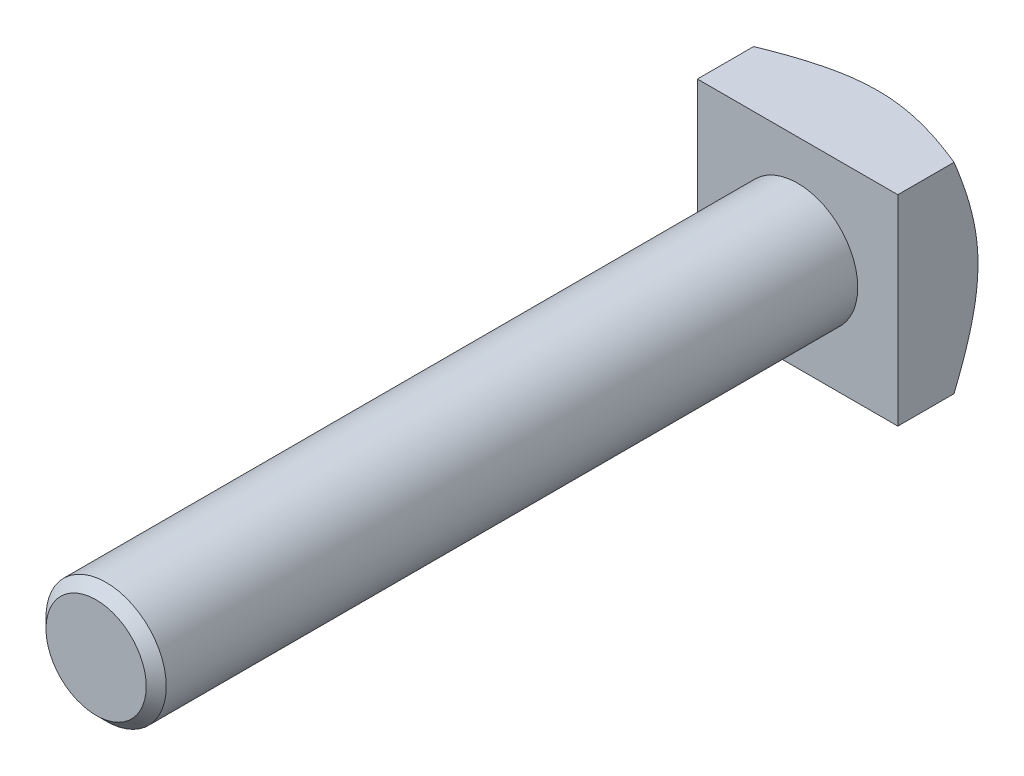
ISO-10303-21;
HEADER;
FILE_DESCRIPTION(('STEP AP214'),'2;1');
FILE_NAME('part.step','',(''),(''),'','','');
FILE_SCHEMA(('AUTOMOTIVE_DESIGN { 1 0 10303 214 1 1 1 1 }'));
ENDSEC;
DATA;
#1=APPLICATION_CONTEXT('core data for automotive mechanical design processes');
#2=APPLICATION_PROTOCOL_DEFINITION('international standard','automotive_design',2000,#1);
#3=PRODUCT_CONTEXT('',#1,'mechanical');
#4=PRODUCT('Part','Part','',(#3));
#5=PRODUCT_RELATED_PRODUCT_CATEGORY('part','',(#4));
#6=PRODUCT_DEFINITION_FORMATION('','',#4);
#7=PRODUCT_DEFINITION_CONTEXT('part definition',#1,'design');
#8=PRODUCT_DEFINITION('design','',#6,#7);
#9=PRODUCT_DEFINITION_SHAPE('','',#8);
#10=(LENGTH_UNIT() NAMED_UNIT(*) SI_UNIT(.MILLI.,.METRE.));
#11=(NAMED_UNIT(*) PLANE_ANGLE_UNIT() SI_UNIT($,.RADIAN.));
#12=(NAMED_UNIT(*) SI_UNIT($,.STERADIAN.) SOLID_ANGLE_UNIT());
#13=UNCERTAINTY_MEASURE_WITH_UNIT(LENGTH_MEASURE(1.E-05),#10,'distance_accuracy_value','');
#14=(GEOMETRIC_REPRESENTATION_CONTEXT(3) GLOBAL_UNCERTAINTY_ASSIGNED_CONTEXT((#13)) GLOBAL_UNIT_ASSIGNED_CONTEXT((#10,
#11,#12)) REPRESENTATION_CONTEXT('',''));
#15=CARTESIAN_POINT('',(0.,0.,0.));
#16=DIRECTION('',(0.,0.,1.));
#17=DIRECTION('',(1.,0.,0.));
#18=AXIS2_PLACEMENT_3D('',#15,#16,#17);
#19=CARTESIAN_POINT('',(-5.,5.,0.));
#20=DIRECTION('',(0.,0.,1.));
#21=DIRECTION('',(1.,0.,0.));
#22=AXIS2_PLACEMENT_3D('',#19,#20,#21);
#23=PLANE('',#22);
#24=DIRECTION('',(0.,-1.,0.));
#25=VECTOR('',#24,1.);
#26=CARTESIAN_POINT('',(-5.,5.,0.));
#27=LINE('',#26,#25);
#28=CARTESIAN_POINT('',(-5.,5.,0.));
#29=VERTEX_POINT('',#28);
#30=CARTESIAN_POINT('',(-5.,-5.,0.));
#31=VERTEX_POINT('',#30);
#32=EDGE_CURVE('E105',#29,#31,#27,.T.);
#33=ORIENTED_EDGE('',*,*,#32,.T.);
#34=DIRECTION('',(1.,0.,0.));
#35=VECTOR('',#34,1.);
#36=CARTESIAN_POINT('',(-5.,-5.,0.));
#37=LINE('',#36,#35);
#38=CARTESIAN_POINT('',(5.,-5.,0.));
#39=VERTEX_POINT('',#38);
#40=EDGE_CURVE('E291',#31,#39,#37,.T.);
#41=ORIENTED_EDGE('',*,*,#40,.T.);
#42=DIRECTION('',(0.,1.,0.));
#43=VECTOR('',#42,1.);
#44=CARTESIAN_POINT('',(5.,5.,0.));
#45=LINE('',#44,#43);
#46=CARTESIAN_POINT('',(5.,5.,0.));
#47=VERTEX_POINT('',#46);
#48=EDGE_CURVE('E290',#39,#47,#45,.T.);
#49=ORIENTED_EDGE('',*,*,#48,.T.);
#50=DIRECTION('',(-1.,0.,0.));
#51=VECTOR('',#50,1.);
#52=CARTESIAN_POINT('',(-5.,5.,0.));
#53=LINE('',#52,#51);
#54=EDGE_CURVE('E117',#47,#29,#53,.T.);
#55=ORIENTED_EDGE('',*,*,#54,.T.);
#56=EDGE_LOOP('',(#33,#41,#49,#55));
#57=FACE_BOUND('',#56,.T.);
#58=CARTESIAN_POINT('',(0.,0.,0.));
#59=DIRECTION('',(0.,0.,1.));
#60=DIRECTION('',(1.,0.,0.));
#61=AXIS2_PLACEMENT_3D('',#58,#59,#60);
#62=CIRCLE('',#61,3.);
#63=CARTESIAN_POINT('',(3.,0.,0.));
#64=VERTEX_POINT('',#63);
#65=EDGE_CURVE('E196',#64,#64,#62,.T.);
#66=ORIENTED_EDGE('',*,*,#65,.F.);
#67=EDGE_LOOP('',(#66));
#68=FACE_BOUND('',#67,.T.);
#69=ADVANCED_FACE('F34',(#57,#68),#23,.T.);
#70=CARTESIAN_POINT('',(-5.,5.,-4.));
#71=DIRECTION('',(-1.,0.,0.));
#72=DIRECTION('',(0.,-1.,0.));
#73=AXIS2_PLACEMENT_3D('',#70,#71,#72);
#74=PLANE('',#73);
#75=DIRECTION('',(0.,0.,1.));
#76=VECTOR('',#75,1.);
#77=CARTESIAN_POINT('',(-5.,5.,-4.));
#78=LINE('',#77,#76);
#79=CARTESIAN_POINT('',(-5.,5.,-2.80426844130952));
#80=VERTEX_POINT('',#79);
#81=EDGE_CURVE('E100',#80,#29,#78,.T.);
#82=ORIENTED_EDGE('',*,*,#81,.F.);
#83=CARTESIAN_POINT('',(-5.,-9.8181322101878,-0.525521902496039));
#84=CARTESIAN_POINT('',(-5.,-9.57661979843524,-0.649754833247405));
#85=CARTESIAN_POINT('',(-5.,-9.33473590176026,-0.773272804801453));
#86=CARTESIAN_POINT('',(-5.,-8.85003214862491,-1.01849672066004));
#87=CARTESIAN_POINT('',(-5.,-8.60721223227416,-1.14020254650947));
#88=CARTESIAN_POINT('',(-5.,-8.11989074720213,-1.38169323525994));
#89=CARTESIAN_POINT('',(-5.,-7.87538654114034,-1.50147278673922));
#90=CARTESIAN_POINT('',(-5.,-7.38504530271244,-1.73826229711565));
#91=CARTESIAN_POINT('',(-5.,-7.13920830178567,-1.85527232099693));
#92=CARTESIAN_POINT('',(-5.,-6.63230240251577,-2.09216909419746));
#93=CARTESIAN_POINT('',(-5.,-6.37114106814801,-2.21185870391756));
#94=CARTESIAN_POINT('',(-5.,-5.84655275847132,-2.4462350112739));
#95=CARTESIAN_POINT('',(-5.,-5.58312563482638,-2.56092137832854));
#96=CARTESIAN_POINT('',(-5.,-5.05372038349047,-2.78361353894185));
#97=CARTESIAN_POINT('',(-5.,-4.78774472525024,-2.8916251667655));
#98=CARTESIAN_POINT('',(-5.,-4.25242340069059,-3.09889095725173));
#99=CARTESIAN_POINT('',(-5.,-3.98307829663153,-3.19814655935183));
#100=CARTESIAN_POINT('',(-5.,-3.44329486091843,-3.38390258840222));
#101=CARTESIAN_POINT('',(-5.,-3.17290140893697,-3.47053170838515));
#102=CARTESIAN_POINT('',(-5.,-2.62760842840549,-3.62849436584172));
#103=CARTESIAN_POINT('',(-5.,-2.35270885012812,-3.6998277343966));
#104=CARTESIAN_POINT('',(-5.,-1.80366332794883,-3.82133150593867));
#105=CARTESIAN_POINT('',(-5.,-1.52960459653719,-3.87188258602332));
#106=CARTESIAN_POINT('',(-5.,-1.11606109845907,-3.92997071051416));
#107=CARTESIAN_POINT('',(-5.,-0.977799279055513,-3.9463772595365));
#108=CARTESIAN_POINT('',(-5.,-0.700676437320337,-3.97285973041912));
#109=CARTESIAN_POINT('',(-5.,-0.561815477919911,-3.98293630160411));
#110=CARTESIAN_POINT('',(-5.,-0.25566039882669,-3.99782694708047));
#111=CARTESIAN_POINT('',(-5.,-0.088292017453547,-4.00116576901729));
#112=CARTESIAN_POINT('',(-5.,0.24635848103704,-3.99811302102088));
#113=CARTESIAN_POINT('',(-5.,0.413640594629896,-3.99172108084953));
#114=CARTESIAN_POINT('',(-5.,0.747605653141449,-3.96948164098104));
#115=CARTESIAN_POINT('',(-5.,0.914288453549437,-3.95363199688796));
#116=CARTESIAN_POINT('',(-5.,1.24656987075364,-3.91311443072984));
#117=CARTESIAN_POINT('',(-5.,1.41216845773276,-3.88844626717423));
#118=CARTESIAN_POINT('',(-5.,1.7464533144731,-3.83039231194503));
#119=CARTESIAN_POINT('',(-5.,1.91510124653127,-3.79678789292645));
#120=CARTESIAN_POINT('',(-5.,2.25076132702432,-3.72226542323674));
#121=CARTESIAN_POINT('',(-5.,2.41777343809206,-3.68134720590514));
#122=CARTESIAN_POINT('',(-5.,2.75019095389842,-3.5932361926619));
#123=CARTESIAN_POINT('',(-5.,2.91559571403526,-3.54604098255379));
#124=CARTESIAN_POINT('',(-5.,3.24477921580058,-3.44635513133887));
#125=CARTESIAN_POINT('',(-5.,3.40855805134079,-3.39386479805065));
#126=CARTESIAN_POINT('',(-5.,3.87929706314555,-3.2359042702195));
#127=CARTESIAN_POINT('',(-5.,4.18434985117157,-3.12475317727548));
#128=CARTESIAN_POINT('',(-5.,4.7901230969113,-2.89114754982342));
#129=CARTESIAN_POINT('',(-5.,5.09084225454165,-2.76868970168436));
#130=CARTESIAN_POINT('',(-5.,5.68908980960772,-2.51546799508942));
#131=CARTESIAN_POINT('',(-5.,5.98661480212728,-2.3846961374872));
#132=CARTESIAN_POINT('',(-5.,6.57888937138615,-2.11713113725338));
#133=CARTESIAN_POINT('',(-5.,6.87363925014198,-1.98033865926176));
#134=CARTESIAN_POINT('',(-5.,7.4619850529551,-1.70174649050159));
#135=CARTESIAN_POINT('',(-5.,7.75557363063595,-1.55993133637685));
#136=CARTESIAN_POINT('',(-5.,8.34104075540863,-1.27280668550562));
#137=CARTESIAN_POINT('',(-5.,8.63291926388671,-1.1274971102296));
#138=CARTESIAN_POINT('',(-5.,9.21514119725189,-0.834242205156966));
#139=CARTESIAN_POINT('',(-5.,9.505485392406,-0.686298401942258));
#140=CARTESIAN_POINT('',(-5.,10.0850672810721,-0.388257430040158));
#141=CARTESIAN_POINT('',(-5.,10.3743049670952,-0.238160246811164));
#142=CARTESIAN_POINT('',(-5.,11.1629351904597,0.174076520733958));
#143=CARTESIAN_POINT('',(-5.,11.6614305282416,0.437931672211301));
#144=CARTESIAN_POINT('',(-5.,12.6565597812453,0.969306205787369));
#145=CARTESIAN_POINT('',(-5.,13.1531933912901,1.23682615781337));
#146=CARTESIAN_POINT('',(-5.,14.1416141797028,1.77266374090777));
#147=CARTESIAN_POINT('',(-5.,14.6334112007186,2.04096323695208));
#148=CARTESIAN_POINT('',(-5.,15.6158183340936,2.57951757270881));
#149=CARTESIAN_POINT('',(-5.,16.1064286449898,2.8497720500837));
#150=CARTESIAN_POINT('',(-5.,16.5966492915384,3.12072532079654));
#151=B_SPLINE_CURVE_WITH_KNOTS('',3,(#83,#84,#85,#86,#87,#88,#89,#90,#91,#92,#93,#94,#95,#96,
#97,#98,#99,#100,#101,#102,#103,#104,#105,#106,#107,#108,#109,#110,#111,#112,#113,#114,#115,
#116,#117,#118,#119,#120,#121,#122,#123,#124,#125,#126,#127,#128,#129,#130,#131,#132,#133,#134,
#135,#136,#137,#138,#139,#140,#141,#142,#143,#144,#145,#146,#147,#148,#149,#150),.UNSPECIFIED.,
.F.,.F.,(4,2,2,2,2,2,2,2,2,2,2,2,2,2,2,2,2,2,2,2,2,2,2,2,2,2,2,2,2,2,2,2,2,4),(0.,
0.814778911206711,1.62961085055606,2.44639841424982,3.26316679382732,4.1249719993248,
4.98683406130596,5.84793180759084,6.70888772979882,7.56034087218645,8.41180341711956,
9.24688809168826,9.66445888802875,10.0819868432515,10.5839030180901,11.0858382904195,
11.5878874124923,12.0899502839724,12.6056528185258,13.1213671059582,13.6372803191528,
14.1531635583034,15.1268211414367,16.1007649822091,17.0756604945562,18.050448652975,
19.0285559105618,20.0066851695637,20.9842649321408,21.9618512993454,23.6538834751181,
25.3461818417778,27.0268432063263,28.7072006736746),.UNSPECIFIED.);
#152=CARTESIAN_POINT('',(-5.,0.,-4.));
#153=VERTEX_POINT('',#152);
#154=EDGE_CURVE('E86',#80,#153,#151,.F.);
#155=ORIENTED_EDGE('',*,*,#154,.T.);
#156=CARTESIAN_POINT('',(-5.,-5.,-2.80426844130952));
#157=VERTEX_POINT('',#156);
#158=EDGE_CURVE('E58',#153,#157,#151,.F.);
#159=ORIENTED_EDGE('',*,*,#158,.T.);
#160=DIRECTION('',(0.,0.,1.));
#161=VECTOR('',#160,1.);
#162=CARTESIAN_POINT('',(-5.,-5.,-4.));
#163=LINE('',#162,#161);
#164=EDGE_CURVE('E121',#157,#31,#163,.T.);
#165=ORIENTED_EDGE('',*,*,#164,.T.);
#166=ORIENTED_EDGE('',*,*,#32,.F.);
#167=EDGE_LOOP('',(#82,#155,#159,#165,#166));
#168=FACE_BOUND('',#167,.T.);
#169=ADVANCED_FACE('F36',(#168),#74,.T.);
#170=CARTESIAN_POINT('',(-5.,5.,-4.));
#171=DIRECTION('',(0.,1.,0.));
#172=DIRECTION('',(0.,0.,1.));
#173=AXIS2_PLACEMENT_3D('',#170,#171,#172);
#174=PLANE('',#173);
#175=DIRECTION('',(0.,0.,1.));
#176=VECTOR('',#175,1.);
#177=CARTESIAN_POINT('',(5.,5.,-4.));
#178=LINE('',#177,#176);
#179=CARTESIAN_POINT('',(5.,5.,-2.80426844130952));
#180=VERTEX_POINT('',#179);
#181=EDGE_CURVE('E108',#180,#47,#178,.T.);
#182=ORIENTED_EDGE('',*,*,#181,.F.);
#183=CARTESIAN_POINT('',(-9.81813221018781,5.,-0.525521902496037));
#184=CARTESIAN_POINT('',(-9.57661979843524,5.,-0.649754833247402));
#185=CARTESIAN_POINT('',(-9.33473590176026,5.,-0.773272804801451));
#186=CARTESIAN_POINT('',(-8.85003214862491,5.,-1.01849672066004));
#187=CARTESIAN_POINT('',(-8.60721223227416,5.,-1.14020254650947));
#188=CARTESIAN_POINT('',(-8.11989074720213,5.,-1.38169323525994));
#189=CARTESIAN_POINT('',(-7.87538654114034,5.,-1.50147278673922));
#190=CARTESIAN_POINT('',(-7.38504530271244,5.,-1.73826229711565));
#191=CARTESIAN_POINT('',(-7.13920830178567,5.,-1.85527232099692));
#192=CARTESIAN_POINT('',(-6.63230240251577,5.,-2.09216909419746));
#193=CARTESIAN_POINT('',(-6.37114106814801,5.,-2.21185870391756));
#194=CARTESIAN_POINT('',(-5.84655275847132,5.,-2.4462350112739));
#195=CARTESIAN_POINT('',(-5.58312563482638,5.,-2.56092137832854));
#196=CARTESIAN_POINT('',(-5.05372038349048,5.,-2.78361353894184));
#197=CARTESIAN_POINT('',(-4.78774472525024,5.,-2.8916251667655));
#198=CARTESIAN_POINT('',(-4.25242340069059,5.,-3.09889095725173));
#199=CARTESIAN_POINT('',(-3.98307829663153,5.,-3.19814655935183));
#200=CARTESIAN_POINT('',(-3.44329486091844,5.,-3.38390258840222));
#201=CARTESIAN_POINT('',(-3.17290140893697,5.,-3.47053170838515));
#202=CARTESIAN_POINT('',(-2.62760842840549,5.,-3.62849436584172));
#203=CARTESIAN_POINT('',(-2.35270885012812,5.,-3.6998277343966));
#204=CARTESIAN_POINT('',(-1.80366332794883,5.,-3.82133150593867));
#205=CARTESIAN_POINT('',(-1.52960459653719,5.,-3.87188258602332));
#206=CARTESIAN_POINT('',(-1.11606109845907,5.,-3.92997071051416));
#207=CARTESIAN_POINT('',(-0.977799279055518,5.,-3.9463772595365));
#208=CARTESIAN_POINT('',(-0.700676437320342,5.,-3.97285973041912));
#209=CARTESIAN_POINT('',(-0.561815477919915,5.,-3.98293630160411));
#210=CARTESIAN_POINT('',(-0.255660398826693,5.,-3.99782694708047));
#211=CARTESIAN_POINT('',(-0.0882920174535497,5.,-4.0011657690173));
#212=CARTESIAN_POINT('',(0.246358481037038,5.,-3.99811302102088));
#213=CARTESIAN_POINT('',(0.413640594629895,5.,-3.99172108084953));
#214=CARTESIAN_POINT('',(0.747605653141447,5.,-3.96948164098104));
#215=CARTESIAN_POINT('',(0.914288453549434,5.,-3.95363199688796));
#216=CARTESIAN_POINT('',(1.24656987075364,5.,-3.91311443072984));
#217=CARTESIAN_POINT('',(1.41216845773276,5.,-3.88844626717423));
#218=CARTESIAN_POINT('',(1.7464533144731,5.,-3.83039231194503));
#219=CARTESIAN_POINT('',(1.91510124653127,5.,-3.79678789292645));
#220=CARTESIAN_POINT('',(2.25076132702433,5.,-3.72226542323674));
#221=CARTESIAN_POINT('',(2.41777343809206,5.,-3.68134720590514));
#222=CARTESIAN_POINT('',(2.75019095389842,5.,-3.5932361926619));
#223=CARTESIAN_POINT('',(2.91559571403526,5.,-3.54604098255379));
#224=CARTESIAN_POINT('',(3.24477921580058,5.,-3.44635513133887));
#225=CARTESIAN_POINT('',(3.40855805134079,5.,-3.39386479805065));
#226=CARTESIAN_POINT('',(3.87929706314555,5.,-3.2359042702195));
#227=CARTESIAN_POINT('',(4.18434985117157,5.,-3.12475317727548));
#228=CARTESIAN_POINT('',(4.7901230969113,5.,-2.89114754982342));
#229=CARTESIAN_POINT('',(5.09084225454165,5.,-2.76868970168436));
#230=CARTESIAN_POINT('',(5.68908980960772,5.,-2.51546799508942));
#231=CARTESIAN_POINT('',(5.98661480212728,5.,-2.3846961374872));
#232=CARTESIAN_POINT('',(6.57888937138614,5.,-2.11713113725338));
#233=CARTESIAN_POINT('',(6.87363925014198,5.,-1.98033865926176));
#234=CARTESIAN_POINT('',(7.46198505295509,5.,-1.70174649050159));
#235=CARTESIAN_POINT('',(7.75557363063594,5.,-1.55993133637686));
#236=CARTESIAN_POINT('',(8.34104075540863,5.,-1.27280668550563));
#237=CARTESIAN_POINT('',(8.63291926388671,5.,-1.1274971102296));
#238=CARTESIAN_POINT('',(9.21514119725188,5.,-0.834242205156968));
#239=CARTESIAN_POINT('',(9.50548539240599,5.,-0.686298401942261));
#240=CARTESIAN_POINT('',(10.0850672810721,5.,-0.388257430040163));
#241=CARTESIAN_POINT('',(10.3743049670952,5.,-0.238160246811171));
#242=CARTESIAN_POINT('',(11.1629351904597,5.,0.174076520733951));
#243=CARTESIAN_POINT('',(11.6614305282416,5.,0.437931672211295));
#244=CARTESIAN_POINT('',(12.6565597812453,5.,0.969306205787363));
#245=CARTESIAN_POINT('',(13.1531933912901,5.,1.23682615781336));
#246=CARTESIAN_POINT('',(14.1416141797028,5.,1.77266374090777));
#247=CARTESIAN_POINT('',(14.6334112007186,5.,2.04096323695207));
#248=CARTESIAN_POINT('',(15.6158183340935,5.,2.5795175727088));
#249=CARTESIAN_POINT('',(16.1064286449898,5.,2.84977205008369));
#250=CARTESIAN_POINT('',(16.5966492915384,5.,3.12072532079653));
#251=B_SPLINE_CURVE_WITH_KNOTS('',3,(#183,#184,#185,#186,#187,#188,#189,#190,#191,#192,#193,
#194,#195,#196,#197,#198,#199,#200,#201,#202,#203,#204,#205,#206,#207,#208,#209,#210,#211,#212,
#213,#214,#215,#216,#217,#218,#219,#220,#221,#222,#223,#224,#225,#226,#227,#228,#229,#230,#231,
#232,#233,#234,#235,#236,#237,#238,#239,#240,#241,#242,#243,#244,#245,#246,#247,#248,#249,#250),
.UNSPECIFIED.,.F.,.F.,(4,2,2,2,2,2,2,2,2,2,2,2,2,2,2,2,2,2,2,2,2,2,2,2,2,2,2,2,2,2,2,2,2,4),(0.,
0.814778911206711,1.62961085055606,2.44639841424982,3.26316679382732,4.1249719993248,
4.98683406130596,5.84793180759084,6.70888772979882,7.56034087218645,8.41180341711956,
9.24688809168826,9.66445888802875,10.0819868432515,10.5839030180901,11.0858382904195,
11.5878874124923,12.0899502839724,12.6056528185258,13.1213671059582,13.6372803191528,
14.1531635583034,15.1268211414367,16.1007649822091,17.0756604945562,18.050448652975,
19.0285559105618,20.0066851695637,20.9842649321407,21.9618512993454,23.6538834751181,
25.3461818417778,27.0268432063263,28.7072006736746),.UNSPECIFIED.);
#252=CARTESIAN_POINT('',(0.,5.,-4.));
#253=VERTEX_POINT('',#252);
#254=EDGE_CURVE('E102',#180,#253,#251,.F.);
#255=ORIENTED_EDGE('',*,*,#254,.T.);
#256=EDGE_CURVE('E50',#253,#80,#251,.F.);
#257=ORIENTED_EDGE('',*,*,#256,.T.);
#258=ORIENTED_EDGE('',*,*,#81,.T.);
#259=ORIENTED_EDGE('',*,*,#54,.F.);
#260=EDGE_LOOP('',(#182,#255,#257,#258,#259));
#261=FACE_BOUND('',#260,.T.);
#262=ADVANCED_FACE('F98',(#261),#174,.T.);
#263=CARTESIAN_POINT('',(5.,5.,-4.));
#264=DIRECTION('',(1.,0.,0.));
#265=DIRECTION('',(0.,1.,0.));
#266=AXIS2_PLACEMENT_3D('',#263,#264,#265);
#267=PLANE('',#266);
#268=DIRECTION('',(0.,0.,1.));
#269=VECTOR('',#268,1.);
#270=CARTESIAN_POINT('',(5.,-5.,-4.));
#271=LINE('',#270,#269);
#272=CARTESIAN_POINT('',(5.,-5.,-2.80426844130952));
#273=VERTEX_POINT('',#272);
#274=EDGE_CURVE('E114',#273,#39,#271,.T.);
#275=ORIENTED_EDGE('',*,*,#274,.F.);
#276=CARTESIAN_POINT('',(5.,-9.81813221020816,-0.525521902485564));
#277=CARTESIAN_POINT('',(5.,-9.5766197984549,-0.649754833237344));
#278=CARTESIAN_POINT('',(5.,-9.33473590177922,-0.773272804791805));
#279=CARTESIAN_POINT('',(5.,-8.85003214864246,-1.01849672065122));
#280=CARTESIAN_POINT('',(5.,-8.60721223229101,-1.14020254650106));
#281=CARTESIAN_POINT('',(5.,-8.11989074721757,-1.38169323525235));
#282=CARTESIAN_POINT('',(5.,-7.87538654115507,-1.50147278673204));
#283=CARTESIAN_POINT('',(5.,-7.38504530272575,-1.73826229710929));
#284=CARTESIAN_POINT('',(5.,-7.13920830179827,-1.85527232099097));
#285=CARTESIAN_POINT('',(5.,-6.63230240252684,-2.09216909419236));
#286=CARTESIAN_POINT('',(5.,-6.37114106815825,-2.21185870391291));
#287=CARTESIAN_POINT('',(5.,-5.84655275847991,-2.44623501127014));
#288=CARTESIAN_POINT('',(5.,-5.58312563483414,-2.56092137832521));
#289=CARTESIAN_POINT('',(5.,-5.05372038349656,-2.78361353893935));
#290=CARTESIAN_POINT('',(5.,-4.78774472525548,-2.89162516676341));
#291=CARTESIAN_POINT('',(5.,-4.25242340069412,-3.09889095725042));
#292=CARTESIAN_POINT('',(5.,-3.9830782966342,-3.19814655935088));
#293=CARTESIAN_POINT('',(5.,-3.4432948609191,-3.38390258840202));
#294=CARTESIAN_POINT('',(5.,-3.17290140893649,-3.47053170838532));
#295=CARTESIAN_POINT('',(5.,-2.62760842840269,-3.6284943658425));
#296=CARTESIAN_POINT('',(5.,-2.35270885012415,-3.69982773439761));
#297=CARTESIAN_POINT('',(5.,-1.8036633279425,-3.82133150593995));
#298=CARTESIAN_POINT('',(5.,-1.52960459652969,-3.87188258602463));
#299=CARTESIAN_POINT('',(5.,-1.1160610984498,-3.92997071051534));
#300=CARTESIAN_POINT('',(5.,-0.977799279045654,-3.9463772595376));
#301=CARTESIAN_POINT('',(5.,-0.7006764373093,-3.97285973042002));
#302=CARTESIAN_POINT('',(5.,-0.561815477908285,-3.98293630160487));
#303=CARTESIAN_POINT('',(5.,-0.255660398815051,-3.99782694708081));
#304=CARTESIAN_POINT('',(5.,-0.0882920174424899,-4.0011657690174));
#305=CARTESIAN_POINT('',(5.,0.246358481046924,-3.99811302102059));
#306=CARTESIAN_POINT('',(5.,0.413640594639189,-3.99172108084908));
#307=CARTESIAN_POINT('',(5.,0.747605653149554,-3.96948164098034));
#308=CARTESIAN_POINT('',(5.,0.914288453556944,-3.95363199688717));
#309=CARTESIAN_POINT('',(5.,1.24656987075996,-3.91311443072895));
#310=CARTESIAN_POINT('',(5.,1.41216845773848,-3.88844626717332));
#311=CARTESIAN_POINT('',(5.,1.74645331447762,-3.83039231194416));
#312=CARTESIAN_POINT('',(5.,1.91510124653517,-3.79678789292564));
#313=CARTESIAN_POINT('',(5.,2.25076132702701,-3.72226542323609));
#314=CARTESIAN_POINT('',(5.,2.41777343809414,-3.6813472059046));
#315=CARTESIAN_POINT('',(5.,2.75019095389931,-3.59323619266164));
#316=CARTESIAN_POINT('',(5.,2.91559571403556,-3.54604098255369));
#317=CARTESIAN_POINT('',(5.,3.24477921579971,-3.44635513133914));
#318=CARTESIAN_POINT('',(5.,3.40855805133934,-3.39386479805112));
#319=CARTESIAN_POINT('',(5.,3.87929706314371,-3.23590427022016));
#320=CARTESIAN_POINT('',(5.,4.18434985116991,-3.1247531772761));
#321=CARTESIAN_POINT('',(5.,4.79012309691,-2.89114754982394));
#322=CARTESIAN_POINT('',(5.,5.09084225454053,-2.76868970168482));
#323=CARTESIAN_POINT('',(5.,5.68908980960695,-2.51546799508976));
#324=CARTESIAN_POINT('',(5.,5.98661480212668,-2.38469613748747));
#325=CARTESIAN_POINT('',(5.,6.57888937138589,-2.1171311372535));
#326=CARTESIAN_POINT('',(5.,6.87363925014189,-1.9803386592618));
#327=CARTESIAN_POINT('',(5.,7.46198505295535,-1.70174649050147));
#328=CARTESIAN_POINT('',(5.,7.75557363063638,-1.55993133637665));
#329=CARTESIAN_POINT('',(5.,8.3410407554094,-1.27280668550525));
#330=CARTESIAN_POINT('',(5.,8.63291926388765,-1.12749711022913));
#331=CARTESIAN_POINT('',(5.,9.21514119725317,-0.834242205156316));
#332=CARTESIAN_POINT('',(5.,9.50548539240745,-0.686298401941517));
#333=CARTESIAN_POINT('',(5.,10.0850672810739,-0.388257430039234));
#334=CARTESIAN_POINT('',(5.,10.3743049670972,-0.238160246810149));
#335=CARTESIAN_POINT('',(5.,11.1629351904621,0.174076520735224));
#336=CARTESIAN_POINT('',(5.,11.6614305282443,0.437931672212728));
#337=CARTESIAN_POINT('',(5.,12.6565597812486,0.969306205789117));
#338=CARTESIAN_POINT('',(5.,13.1531933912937,1.23682615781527));
#339=CARTESIAN_POINT('',(5.,14.1416141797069,1.77266374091));
#340=CARTESIAN_POINT('',(5.,14.6334112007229,2.04096323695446));
#341=CARTESIAN_POINT('',(5.,15.6158183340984,2.5795175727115));
#342=CARTESIAN_POINT('',(5.,16.106428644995,2.84977205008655));
#343=CARTESIAN_POINT('',(5.,16.5966492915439,3.12072532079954));
#344=B_SPLINE_CURVE_WITH_KNOTS('',3,(#276,#277,#278,#279,#280,#281,#282,#283,#284,#285,#286,
#287,#288,#289,#290,#291,#292,#293,#294,#295,#296,#297,#298,#299,#300,#301,#302,#303,#304,#305,
#306,#307,#308,#309,#310,#311,#312,#313,#314,#315,#316,#317,#318,#319,#320,#321,#322,#323,#324,
#325,#326,#327,#328,#329,#330,#331,#332,#333,#334,#335,#336,#337,#338,#339,#340,#341,#342,#343),
.UNSPECIFIED.,.F.,.F.,(4,2,2,2,2,2,2,2,2,2,2,2,2,2,2,2,2,2,2,2,2,2,2,2,2,2,2,2,2,2,2,2,2,4),(0.,
0.814778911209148,1.62961085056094,2.44639841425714,3.26316679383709,4.12497199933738,
4.98683406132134,5.84793180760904,6.70888772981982,7.56034087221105,8.41180341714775,
9.24688809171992,9.66445888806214,10.0819868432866,10.5839030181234,11.0858382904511,
11.5878874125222,12.0899502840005,12.6056528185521,13.1213671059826,13.6372803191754,
14.1531635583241,15.1268211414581,16.100764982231,17.0756604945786,18.050448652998,
19.0285559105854,20.0066851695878,20.9842649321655,21.9618512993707,23.6538834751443,
25.346181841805,27.0268432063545,28.7072006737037),.UNSPECIFIED.);
#345=CARTESIAN_POINT('',(5.,0.,-4.));
#346=VERTEX_POINT('',#345);
#347=EDGE_CURVE('E138',#273,#346,#344,.T.);
#348=ORIENTED_EDGE('',*,*,#347,.T.);
#349=EDGE_CURVE('E93',#346,#180,#344,.T.);
#350=ORIENTED_EDGE('',*,*,#349,.T.);
#351=ORIENTED_EDGE('',*,*,#181,.T.);
#352=ORIENTED_EDGE('',*,*,#48,.F.);
#353=EDGE_LOOP('',(#275,#348,#350,#351,#352));
#354=FACE_BOUND('',#353,.T.);
#355=ADVANCED_FACE('F180',(#354),#267,.T.);
#356=CARTESIAN_POINT('',(-5.,-5.,-4.));
#357=DIRECTION('',(0.,-1.,0.));
#358=DIRECTION('',(1.,0.,0.));
#359=AXIS2_PLACEMENT_3D('',#356,#357,#358);
#360=PLANE('',#359);
#361=ORIENTED_EDGE('',*,*,#164,.F.);
#362=CARTESIAN_POINT('',(-9.8181322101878,-5.,-0.525521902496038));
#363=CARTESIAN_POINT('',(-9.57661979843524,-5.,-0.649754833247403));
#364=CARTESIAN_POINT('',(-9.33473590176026,-5.,-0.773272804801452));
#365=CARTESIAN_POINT('',(-8.85003214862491,-5.,-1.01849672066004));
#366=CARTESIAN_POINT('',(-8.60721223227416,-5.,-1.14020254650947));
#367=CARTESIAN_POINT('',(-8.11989074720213,-5.,-1.38169323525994));
#368=CARTESIAN_POINT('',(-7.87538654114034,-5.,-1.50147278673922));
#369=CARTESIAN_POINT('',(-7.38504530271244,-5.,-1.73826229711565));
#370=CARTESIAN_POINT('',(-7.13920830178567,-5.,-1.85527232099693));
#371=CARTESIAN_POINT('',(-6.63230240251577,-5.,-2.09216909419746));
#372=CARTESIAN_POINT('',(-6.37114106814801,-5.,-2.21185870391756));
#373=CARTESIAN_POINT('',(-5.84655275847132,-5.,-2.4462350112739));
#374=CARTESIAN_POINT('',(-5.58312563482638,-5.,-2.56092137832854));
#375=CARTESIAN_POINT('',(-5.05372038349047,-5.,-2.78361353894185));
#376=CARTESIAN_POINT('',(-4.78774472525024,-5.,-2.8916251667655));
#377=CARTESIAN_POINT('',(-4.25242340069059,-5.,-3.09889095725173));
#378=CARTESIAN_POINT('',(-3.98307829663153,-5.,-3.19814655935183));
#379=CARTESIAN_POINT('',(-3.44329486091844,-5.,-3.38390258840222));
#380=CARTESIAN_POINT('',(-3.17290140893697,-5.,-3.47053170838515));
#381=CARTESIAN_POINT('',(-2.62760842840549,-5.,-3.62849436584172));
#382=CARTESIAN_POINT('',(-2.35270885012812,-5.,-3.6998277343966));
#383=CARTESIAN_POINT('',(-1.80366332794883,-5.,-3.82133150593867));
#384=CARTESIAN_POINT('',(-1.52960459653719,-5.,-3.87188258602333));
#385=CARTESIAN_POINT('',(-1.11606109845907,-5.,-3.92997071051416));
#386=CARTESIAN_POINT('',(-0.977799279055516,-5.,-3.9463772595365));
#387=CARTESIAN_POINT('',(-0.70067643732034,-5.,-3.97285973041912));
#388=CARTESIAN_POINT('',(-0.561815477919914,-5.,-3.98293630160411));
#389=CARTESIAN_POINT('',(-0.255660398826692,-5.,-3.99782694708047));
#390=CARTESIAN_POINT('',(-0.0882920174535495,-5.,-4.0011657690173));
#391=CARTESIAN_POINT('',(0.246358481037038,-5.,-3.99811302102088));
#392=CARTESIAN_POINT('',(0.413640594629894,-5.,-3.99172108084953));
#393=CARTESIAN_POINT('',(0.747605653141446,-5.,-3.96948164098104));
#394=CARTESIAN_POINT('',(0.914288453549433,-5.,-3.95363199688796));
#395=CARTESIAN_POINT('',(1.24656987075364,-5.,-3.91311443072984));
#396=CARTESIAN_POINT('',(1.41216845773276,-5.,-3.88844626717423));
#397=CARTESIAN_POINT('',(1.7464533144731,-5.,-3.83039231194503));
#398=CARTESIAN_POINT('',(1.91510124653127,-5.,-3.79678789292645));
#399=CARTESIAN_POINT('',(2.25076132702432,-5.,-3.72226542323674));
#400=CARTESIAN_POINT('',(2.41777343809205,-5.,-3.68134720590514));
#401=CARTESIAN_POINT('',(2.75019095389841,-5.,-3.5932361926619));
#402=CARTESIAN_POINT('',(2.91559571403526,-5.,-3.54604098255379));
#403=CARTESIAN_POINT('',(3.24477921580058,-5.,-3.44635513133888));
#404=CARTESIAN_POINT('',(3.40855805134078,-5.,-3.39386479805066));
#405=CARTESIAN_POINT('',(3.87929706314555,-5.,-3.2359042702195));
#406=CARTESIAN_POINT('',(4.18434985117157,-5.,-3.12475317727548));
#407=CARTESIAN_POINT('',(4.7901230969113,-5.,-2.89114754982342));
#408=CARTESIAN_POINT('',(5.09084225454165,-5.,-2.76868970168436));
#409=CARTESIAN_POINT('',(5.68908980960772,-5.,-2.51546799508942));
#410=CARTESIAN_POINT('',(5.98661480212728,-5.,-2.3846961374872));
#411=CARTESIAN_POINT('',(6.57888937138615,-5.,-2.11713113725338));
#412=CARTESIAN_POINT('',(6.87363925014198,-5.,-1.98033865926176));
#413=CARTESIAN_POINT('',(7.46198505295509,-5.,-1.70174649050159));
#414=CARTESIAN_POINT('',(7.75557363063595,-5.,-1.55993133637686));
#415=CARTESIAN_POINT('',(8.34104075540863,-5.,-1.27280668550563));
#416=CARTESIAN_POINT('',(8.63291926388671,-5.,-1.1274971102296));
#417=CARTESIAN_POINT('',(9.21514119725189,-5.,-0.834242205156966));
#418=CARTESIAN_POINT('',(9.505485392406,-5.,-0.686298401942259));
#419=CARTESIAN_POINT('',(10.0850672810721,-5.,-0.38825743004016));
#420=CARTESIAN_POINT('',(10.3743049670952,-5.,-0.238160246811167));
#421=CARTESIAN_POINT('',(11.1629351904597,-5.,0.174076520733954));
#422=CARTESIAN_POINT('',(11.6614305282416,-5.,0.437931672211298));
#423=CARTESIAN_POINT('',(12.6565597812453,-5.,0.969306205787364));
#424=CARTESIAN_POINT('',(13.1531933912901,-5.,1.23682615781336));
#425=CARTESIAN_POINT('',(14.1416141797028,-5.,1.77266374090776));
#426=CARTESIAN_POINT('',(14.6334112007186,-5.,2.04096323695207));
#427=CARTESIAN_POINT('',(15.6158183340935,-5.,2.5795175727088));
#428=CARTESIAN_POINT('',(16.1064286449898,-5.,2.84977205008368));
#429=CARTESIAN_POINT('',(16.5966492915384,-5.,3.12072532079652));
#430=B_SPLINE_CURVE_WITH_KNOTS('',3,(#362,#363,#364,#365,#366,#367,#368,#369,#370,#371,#372,
#373,#374,#375,#376,#377,#378,#379,#380,#381,#382,#383,#384,#385,#386,#387,#388,#389,#390,#391,
#392,#393,#394,#395,#396,#397,#398,#399,#400,#401,#402,#403,#404,#405,#406,#407,#408,#409,#410,
#411,#412,#413,#414,#415,#416,#417,#418,#419,#420,#421,#422,#423,#424,#425,#426,#427,#428,#429),
.UNSPECIFIED.,.F.,.F.,(4,2,2,2,2,2,2,2,2,2,2,2,2,2,2,2,2,2,2,2,2,2,2,2,2,2,2,2,2,2,2,2,2,4),(0.,
0.81477891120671,1.62961085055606,2.44639841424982,3.26316679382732,4.12497199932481,
4.98683406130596,5.84793180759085,6.70888772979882,7.56034087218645,8.41180341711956,
9.24688809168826,9.66445888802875,10.0819868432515,10.5839030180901,11.0858382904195,
11.5878874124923,12.0899502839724,12.6056528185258,13.1213671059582,13.6372803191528,
14.1531635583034,15.1268211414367,16.1007649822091,17.0756604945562,18.050448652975,
19.0285559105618,20.0066851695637,20.9842649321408,21.9618512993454,23.6538834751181,
25.3461818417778,27.0268432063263,28.7072006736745),.UNSPECIFIED.);
#431=CARTESIAN_POINT('',(0.,-5.,-4.));
#432=VERTEX_POINT('',#431);
#433=EDGE_CURVE('E130',#157,#432,#430,.T.);
#434=ORIENTED_EDGE('',*,*,#433,.T.);
#435=EDGE_CURVE('E135',#432,#273,#430,.T.);
#436=ORIENTED_EDGE('',*,*,#435,.T.);
#437=ORIENTED_EDGE('',*,*,#274,.T.);
#438=ORIENTED_EDGE('',*,*,#40,.F.);
#439=EDGE_LOOP('',(#361,#434,#436,#437,#438));
#440=FACE_BOUND('',#439,.T.);
#441=ADVANCED_FACE('F144',(#440),#360,.T.);
#442=CARTESIAN_POINT('',(0.,0.,-4.));
#443=DIRECTION('',(0.,0.,1.));
#444=DIRECTION('',(1.,0.,0.));
#445=AXIS2_PLACEMENT_3D('',#442,#443,#444);
#446=CONICAL_SURFACE('',#445,5.,1.0471975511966);
#447=ORIENTED_EDGE('',*,*,#435,.F.);
#448=CARTESIAN_POINT('',(0.,0.,-4.));
#449=DIRECTION('',(0.,0.,1.));
#450=DIRECTION('',(1.,0.,0.));
#451=AXIS2_PLACEMENT_3D('',#448,#449,#450);
#452=CIRCLE('',#451,5.);
#453=EDGE_CURVE('E107',#432,#346,#452,.T.);
#454=ORIENTED_EDGE('',*,*,#453,.T.);
#455=ORIENTED_EDGE('',*,*,#347,.F.);
#456=EDGE_LOOP('',(#447,#454,#455));
#457=FACE_BOUND('',#456,.T.);
#458=ADVANCED_FACE('F136',(#457),#446,.T.);
#459=EDGE_CURVE('E111',#153,#432,#452,.T.);
#460=ORIENTED_EDGE('',*,*,#459,.T.);
#461=ORIENTED_EDGE('',*,*,#433,.F.);
#462=ORIENTED_EDGE('',*,*,#158,.F.);
#463=EDGE_LOOP('',(#460,#461,#462));
#464=FACE_BOUND('',#463,.T.);
#465=ADVANCED_FACE('F128',(#464),#446,.T.);
#466=CARTESIAN_POINT('',(0.,0.,-4.));
#467=DIRECTION('',(0.,0.,-1.));
#468=DIRECTION('',(-1.,0.,0.));
#469=AXIS2_PLACEMENT_3D('',#466,#467,#468);
#470=CIRCLE('',#469,5.);
#471=EDGE_CURVE('E89',#153,#253,#470,.T.);
#472=ORIENTED_EDGE('',*,*,#471,.F.);
#473=ORIENTED_EDGE('',*,*,#154,.F.);
#474=ORIENTED_EDGE('',*,*,#256,.F.);
#475=EDGE_LOOP('',(#472,#473,#474));
#476=FACE_BOUND('',#475,.T.);
#477=ADVANCED_FACE('F87',(#476),#446,.T.);
#478=ORIENTED_EDGE('',*,*,#349,.F.);
#479=EDGE_CURVE('E113',#346,#253,#452,.T.);
#480=ORIENTED_EDGE('',*,*,#479,.T.);
#481=ORIENTED_EDGE('',*,*,#254,.F.);
#482=EDGE_LOOP('',(#478,#480,#481));
#483=FACE_BOUND('',#482,.T.);
#484=ADVANCED_FACE('F162',(#483),#446,.T.);
#485=CARTESIAN_POINT('',(-5.,5.,-4.));
#486=DIRECTION('',(0.,0.,1.));
#487=DIRECTION('',(1.,0.,0.));
#488=AXIS2_PLACEMENT_3D('',#485,#486,#487);
#489=PLANE('',#488);
#490=ORIENTED_EDGE('',*,*,#479,.F.);
#491=ORIENTED_EDGE('',*,*,#453,.F.);
#492=ORIENTED_EDGE('',*,*,#459,.F.);
#493=ORIENTED_EDGE('',*,*,#471,.T.);
#494=EDGE_LOOP('',(#490,#491,#492,#493));
#495=FACE_BOUND('',#494,.T.);
#496=ADVANCED_FACE('F142',(#495),#489,.F.);
#497=CARTESIAN_POINT('',(0.,0.,35.));
#498=DIRECTION('',(0.,0.,-1.));
#499=DIRECTION('',(-1.,0.,0.));
#500=AXIS2_PLACEMENT_3D('',#497,#498,#499);
#501=CYLINDRICAL_SURFACE('',#500,3.);
#502=CARTESIAN_POINT('',(0.,0.,34.5));
#503=DIRECTION('',(0.,0.,1.));
#504=DIRECTION('',(1.,0.,0.));
#505=AXIS2_PLACEMENT_3D('',#502,#503,#504);
#506=CIRCLE('',#505,3.);
#507=CARTESIAN_POINT('',(3.,0.,34.5));
#508=VERTEX_POINT('',#507);
#509=EDGE_CURVE('E11',#508,#508,#506,.F.);
#510=ORIENTED_EDGE('',*,*,#509,.T.);
#511=EDGE_LOOP('',(#510));
#512=FACE_BOUND('',#511,.T.);
#513=ORIENTED_EDGE('',*,*,#65,.T.);
#514=EDGE_LOOP('',(#513));
#515=FACE_BOUND('',#514,.T.);
#516=ADVANCED_FACE('F163',(#512,#515),#501,.T.);
#517=CARTESIAN_POINT('',(0.,0.,35.));
#518=DIRECTION('',(0.,0.,1.));
#519=DIRECTION('',(1.,0.,0.));
#520=AXIS2_PLACEMENT_3D('',#517,#518,#519);
#521=PLANE('',#520);
#522=CARTESIAN_POINT('',(0.,0.,35.));
#523=DIRECTION('',(0.,0.,1.));
#524=DIRECTION('',(1.,0.,0.));
#525=AXIS2_PLACEMENT_3D('',#522,#523,#524);
#526=CIRCLE('',#525,2.49999999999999);
#527=CARTESIAN_POINT('',(2.49999999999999,0.,35.));
#528=VERTEX_POINT('',#527);
#529=EDGE_CURVE('E43',#528,#528,#526,.T.);
#530=ORIENTED_EDGE('',*,*,#529,.T.);
#531=EDGE_LOOP('',(#530));
#532=FACE_BOUND('',#531,.T.);
#533=ADVANCED_FACE('F199',(#532),#521,.T.);
#534=CARTESIAN_POINT('',(0.,0.,35.));
#535=DIRECTION('',(0.,0.,-1.));
#536=DIRECTION('',(-1.,0.,0.));
#537=AXIS2_PLACEMENT_3D('',#534,#535,#536);
#538=CONICAL_SURFACE('',#537,2.49999999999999,0.785398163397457);
#539=ORIENTED_EDGE('',*,*,#509,.F.);
#540=EDGE_LOOP('',(#539));
#541=FACE_BOUND('',#540,.T.);
#542=ORIENTED_EDGE('',*,*,#529,.F.);
#543=EDGE_LOOP('',(#542));
#544=FACE_BOUND('',#543,.T.);
#545=ADVANCED_FACE('F205',(#541,#544),#538,.T.);
#546=CLOSED_SHELL('',(#69,#169,#262,#355,#441,#458,#465,#477,#484,#496,#516,#533,#545));
#547=MANIFOLD_SOLID_BREP('B2',#546);
#548=ADVANCED_BREP_SHAPE_REPRESENTATION('',(#18,#547),#14);
#549=SHAPE_DEFINITION_REPRESENTATION(#9,#548);
ENDSEC;
END-ISO-10303-21;
